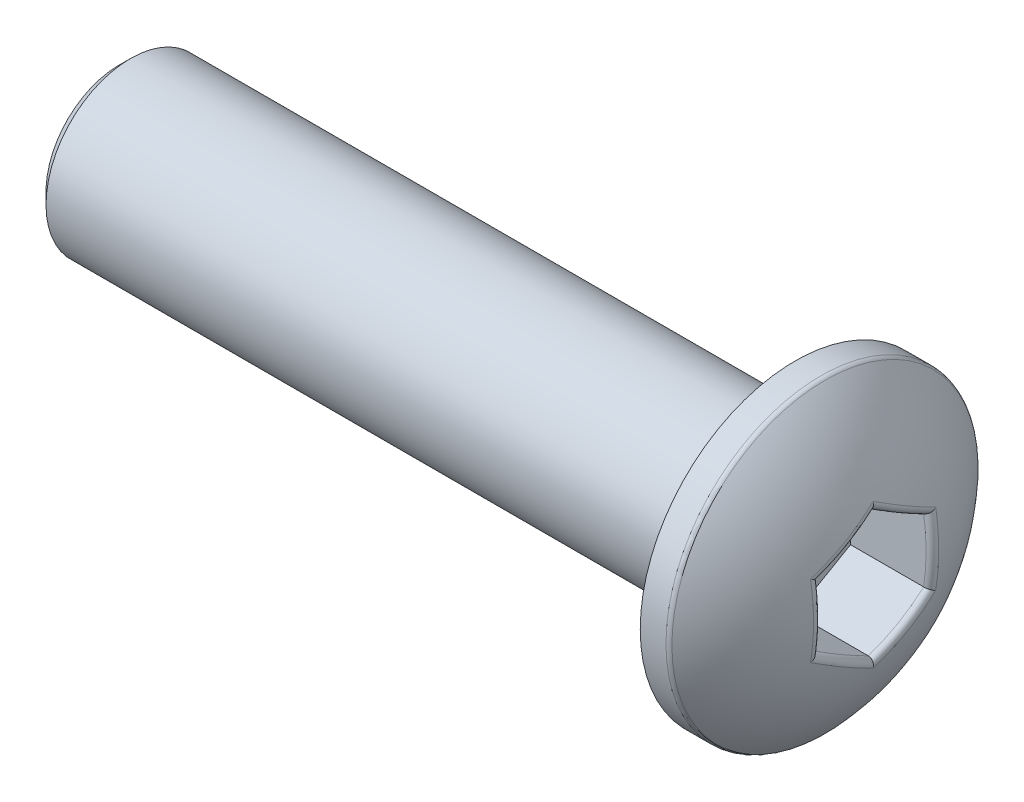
ISO-10303-21;
HEADER;
FILE_DESCRIPTION(('STEP AP214'),'2;1');
FILE_NAME('part.step','',(''),(''),'','','');
FILE_SCHEMA(('AUTOMOTIVE_DESIGN { 1 0 10303 214 1 1 1 1 }'));
ENDSEC;
DATA;
#1=APPLICATION_CONTEXT('core data for automotive mechanical design processes');
#2=APPLICATION_PROTOCOL_DEFINITION('international standard','automotive_design',2000,#1);
#3=PRODUCT_CONTEXT('',#1,'mechanical');
#4=PRODUCT('Part','Part','',(#3));
#5=PRODUCT_RELATED_PRODUCT_CATEGORY('part','',(#4));
#6=PRODUCT_DEFINITION_FORMATION('','',#4);
#7=PRODUCT_DEFINITION_CONTEXT('part definition',#1,'design');
#8=PRODUCT_DEFINITION('design','',#6,#7);
#9=PRODUCT_DEFINITION_SHAPE('','',#8);
#10=(LENGTH_UNIT() NAMED_UNIT(*) SI_UNIT(.MILLI.,.METRE.));
#11=(NAMED_UNIT(*) PLANE_ANGLE_UNIT() SI_UNIT($,.RADIAN.));
#12=(NAMED_UNIT(*) SI_UNIT($,.STERADIAN.) SOLID_ANGLE_UNIT());
#13=UNCERTAINTY_MEASURE_WITH_UNIT(LENGTH_MEASURE(1.E-05),#10,'distance_accuracy_value','');
#14=(GEOMETRIC_REPRESENTATION_CONTEXT(3) GLOBAL_UNCERTAINTY_ASSIGNED_CONTEXT((#13)) GLOBAL_UNIT_ASSIGNED_CONTEXT((#10,
#11,#12)) REPRESENTATION_CONTEXT('',''));
#15=CARTESIAN_POINT('',(0.,0.,0.));
#16=DIRECTION('',(0.,0.,1.));
#17=DIRECTION('',(1.,0.,0.));
#18=AXIS2_PLACEMENT_3D('',#15,#16,#17);
#19=CARTESIAN_POINT('',(9.59526249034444,0.,0.));
#20=DIRECTION('',(-1.,0.,0.));
#21=DIRECTION('',(0.,1.,0.));
#22=AXIS2_PLACEMENT_3D('',#19,#20,#21);
#23=SPHERICAL_SURFACE('',#22,4.);
#24=CARTESIAN_POINT('',(9.59526249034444,-0.962061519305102,0.555446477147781));
#25=DIRECTION('',(0.,0.866025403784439,-0.5));
#26=DIRECTION('',(0.,0.5,0.866025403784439));
#27=AXIS2_PLACEMENT_3D('',#24,#25,#26);
#28=CIRCLE('',#27,3.84264451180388);
#29=CARTESIAN_POINT('',(13.384003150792,-1.2827486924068,0.));
#30=VERTEX_POINT('',#29);
#31=CARTESIAN_POINT('',(13.384003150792,-0.641374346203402,1.11089295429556));
#32=VERTEX_POINT('',#31);
#33=EDGE_CURVE('E155',#30,#32,#28,.F.);
#34=ORIENTED_EDGE('',*,*,#33,.T.);
#35=CARTESIAN_POINT('',(9.59526249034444,0.,1.11089295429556));
#36=DIRECTION('',(0.,0.,-1.));
#37=DIRECTION('',(0.,1.,0.));
#38=AXIS2_PLACEMENT_3D('',#35,#36,#37);
#39=CIRCLE('',#38,3.84264451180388);
#40=CARTESIAN_POINT('',(13.384003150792,0.6413743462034,1.11089295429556));
#41=VERTEX_POINT('',#40);
#42=EDGE_CURVE('E157',#32,#41,#39,.F.);
#43=ORIENTED_EDGE('',*,*,#42,.T.);
#44=CARTESIAN_POINT('',(9.59526249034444,0.962061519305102,0.555446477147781));
#45=DIRECTION('',(0.,-0.866025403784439,-0.5));
#46=DIRECTION('',(0.,0.5,-0.866025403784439));
#47=AXIS2_PLACEMENT_3D('',#44,#45,#46);
#48=CIRCLE('',#47,3.84264451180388);
#49=CARTESIAN_POINT('',(13.384003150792,1.2827486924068,0.));
#50=VERTEX_POINT('',#49);
#51=EDGE_CURVE('E147',#41,#50,#48,.F.);
#52=ORIENTED_EDGE('',*,*,#51,.T.);
#53=CARTESIAN_POINT('',(9.59526249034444,0.9620615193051,-0.55544647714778));
#54=DIRECTION('',(0.,-0.866025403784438,0.5));
#55=DIRECTION('',(0.,-0.5,-0.866025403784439));
#56=AXIS2_PLACEMENT_3D('',#53,#54,#55);
#57=CIRCLE('',#56,3.84264451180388);
#58=CARTESIAN_POINT('',(13.384003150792,0.6413743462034,-1.11089295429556));
#59=VERTEX_POINT('',#58);
#60=EDGE_CURVE('E149',#50,#59,#57,.F.);
#61=ORIENTED_EDGE('',*,*,#60,.T.);
#62=CARTESIAN_POINT('',(9.59526249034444,0.,-1.11089295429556));
#63=DIRECTION('',(0.,0.,1.));
#64=DIRECTION('',(1.,0.,0.));
#65=AXIS2_PLACEMENT_3D('',#62,#63,#64);
#66=CIRCLE('',#65,3.84264451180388);
#67=CARTESIAN_POINT('',(13.384003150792,-0.641374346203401,-1.11089295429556));
#68=VERTEX_POINT('',#67);
#69=EDGE_CURVE('E151',#59,#68,#66,.F.);
#70=ORIENTED_EDGE('',*,*,#69,.T.);
#71=CARTESIAN_POINT('',(9.59526249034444,-0.962061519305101,-0.55544647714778));
#72=DIRECTION('',(0.,0.866025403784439,0.499999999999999));
#73=DIRECTION('',(0.,-0.5,0.866025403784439));
#74=AXIS2_PLACEMENT_3D('',#71,#72,#73);
#75=CIRCLE('',#74,3.84264451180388);
#76=EDGE_CURVE('E153',#68,#30,#75,.F.);
#77=ORIENTED_EDGE('',*,*,#76,.T.);
#78=EDGE_LOOP('',(#34,#43,#52,#61,#70,#77));
#79=FACE_BOUND('',#78,.T.);
#80=CARTESIAN_POINT('',(12.5300120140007,0.,0.));
#81=DIRECTION('',(-1.,0.,0.));
#82=DIRECTION('',(0.,0.,1.));
#83=AXIS2_PLACEMENT_3D('',#80,#81,#82);
#84=CIRCLE('',#83,2.71794871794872);
#85=CARTESIAN_POINT('',(12.5300120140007,0.,2.71794871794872));
#86=VERTEX_POINT('',#85);
#87=EDGE_CURVE('E144',#86,#86,#84,.F.);
#88=ORIENTED_EDGE('',*,*,#87,.T.);
#89=EDGE_LOOP('',(#88));
#90=FACE_BOUND('',#89,.T.);
#91=ADVANCED_FACE('F32',(#79,#90),#23,.T.);
#92=CARTESIAN_POINT('',(0.,0.,0.));
#93=DIRECTION('',(-1.,0.,0.));
#94=DIRECTION('',(0.,0.,1.));
#95=AXIS2_PLACEMENT_3D('',#92,#93,#94);
#96=CYLINDRICAL_SURFACE('',#95,2.75);
#97=CARTESIAN_POINT('',(12.4566432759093,0.,0.));
#98=DIRECTION('',(-1.,0.,0.));
#99=DIRECTION('',(0.,0.,1.));
#100=AXIS2_PLACEMENT_3D('',#97,#98,#99);
#101=CIRCLE('',#100,2.75);
#102=CARTESIAN_POINT('',(12.4566432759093,0.,2.75));
#103=VERTEX_POINT('',#102);
#104=EDGE_CURVE('E11',#103,#103,#101,.T.);
#105=ORIENTED_EDGE('',*,*,#104,.T.);
#106=EDGE_LOOP('',(#105));
#107=FACE_BOUND('',#106,.T.);
#108=CARTESIAN_POINT('',(12.,0.,0.));
#109=DIRECTION('',(-1.,0.,0.));
#110=DIRECTION('',(0.,0.,1.));
#111=AXIS2_PLACEMENT_3D('',#108,#109,#110);
#112=CIRCLE('',#111,2.75);
#113=CARTESIAN_POINT('',(12.,0.,2.75));
#114=VERTEX_POINT('',#113);
#115=EDGE_CURVE('E127',#114,#114,#112,.T.);
#116=ORIENTED_EDGE('',*,*,#115,.F.);
#117=EDGE_LOOP('',(#116));
#118=FACE_BOUND('',#117,.T.);
#119=ADVANCED_FACE('F270',(#107,#118),#96,.T.);
#120=CARTESIAN_POINT('',(12.,1.5,0.));
#121=DIRECTION('',(1.,0.,0.));
#122=DIRECTION('',(0.,0.,-1.));
#123=AXIS2_PLACEMENT_3D('',#120,#121,#122);
#124=PLANE('',#123);
#125=CARTESIAN_POINT('',(12.,0.,0.));
#126=DIRECTION('',(-1.,0.,0.));
#127=DIRECTION('',(0.,0.,1.));
#128=AXIS2_PLACEMENT_3D('',#125,#126,#127);
#129=CIRCLE('',#128,1.5);
#130=CARTESIAN_POINT('',(12.,0.,1.5));
#131=VERTEX_POINT('',#130);
#132=EDGE_CURVE('E123',#131,#131,#129,.T.);
#133=ORIENTED_EDGE('',*,*,#132,.F.);
#134=EDGE_LOOP('',(#133));
#135=FACE_BOUND('',#134,.T.);
#136=ORIENTED_EDGE('',*,*,#115,.T.);
#137=EDGE_LOOP('',(#136));
#138=FACE_BOUND('',#137,.T.);
#139=ADVANCED_FACE('F267',(#135,#138),#124,.F.);
#140=CARTESIAN_POINT('',(0.,0.,0.));
#141=DIRECTION('',(-1.,0.,0.));
#142=DIRECTION('',(0.,0.,1.));
#143=AXIS2_PLACEMENT_3D('',#140,#141,#142);
#144=CYLINDRICAL_SURFACE('',#143,1.5);
#145=CARTESIAN_POINT('',(0.200000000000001,0.,0.));
#146=DIRECTION('',(1.,0.,0.));
#147=DIRECTION('',(0.,0.,-1.));
#148=AXIS2_PLACEMENT_3D('',#145,#146,#147);
#149=CIRCLE('',#148,1.5);
#150=CARTESIAN_POINT('',(0.200000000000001,0.,-1.5));
#151=VERTEX_POINT('',#150);
#152=EDGE_CURVE('E138',#151,#151,#149,.T.);
#153=ORIENTED_EDGE('',*,*,#152,.T.);
#154=EDGE_LOOP('',(#153));
#155=FACE_BOUND('',#154,.T.);
#156=ORIENTED_EDGE('',*,*,#132,.T.);
#157=EDGE_LOOP('',(#156));
#158=FACE_BOUND('',#157,.T.);
#159=ADVANCED_FACE('F263',(#155,#158),#144,.T.);
#160=CARTESIAN_POINT('',(0.,0.,0.));
#161=DIRECTION('',(1.,0.,0.));
#162=DIRECTION('',(0.,0.,-1.));
#163=AXIS2_PLACEMENT_3D('',#160,#161,#162);
#164=PLANE('',#163);
#165=CARTESIAN_POINT('',(0.,0.,0.));
#166=DIRECTION('',(1.,0.,0.));
#167=DIRECTION('',(0.,0.,-1.));
#168=AXIS2_PLACEMENT_3D('',#165,#166,#167);
#169=CIRCLE('',#168,1.3);
#170=CARTESIAN_POINT('',(0.,0.,-1.3));
#171=VERTEX_POINT('',#170);
#172=EDGE_CURVE('E135',#171,#171,#169,.F.);
#173=ORIENTED_EDGE('',*,*,#172,.T.);
#174=EDGE_LOOP('',(#173));
#175=FACE_BOUND('',#174,.T.);
#176=ADVANCED_FACE('F260',(#175),#164,.F.);
#177=CARTESIAN_POINT('',(12.,0.567604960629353,0.983120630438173));
#178=DIRECTION('',(0.,-0.866025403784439,-0.5));
#179=DIRECTION('',(0.,0.5,-0.866025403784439));
#180=AXIS2_PLACEMENT_3D('',#177,#178,#179);
#181=PLANE('',#180);
#182=DIRECTION('',(1.,0.,0.));
#183=VECTOR('',#182,1.);
#184=CARTESIAN_POINT('',(12.,1.13520992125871,0.));
#185=LINE('',#184,#183);
#186=CARTESIAN_POINT('',(12.,1.13520992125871,0.));
#187=VERTEX_POINT('',#186);
#188=CARTESIAN_POINT('',(13.2985953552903,1.13520992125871,0.));
#189=VERTEX_POINT('',#188);
#190=EDGE_CURVE('E116',#187,#189,#185,.T.);
#191=ORIENTED_EDGE('',*,*,#190,.T.);
#192=CARTESIAN_POINT('',(9.59526249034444,0.85140744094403,0.491560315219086));
#193=DIRECTION('',(0.,-0.866025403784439,-0.5));
#194=DIRECTION('',(0.,0.5,-0.866025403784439));
#195=AXIS2_PLACEMENT_3D('',#192,#193,#194);
#196=CIRCLE('',#195,3.74657839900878);
#197=CARTESIAN_POINT('',(13.2985953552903,0.567604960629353,0.983120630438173));
#198=VERTEX_POINT('',#197);
#199=EDGE_CURVE('E39',#189,#198,#196,.T.);
#200=ORIENTED_EDGE('',*,*,#199,.T.);
#201=DIRECTION('',(1.,0.,0.));
#202=VECTOR('',#201,1.);
#203=CARTESIAN_POINT('',(12.,0.567604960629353,0.983120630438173));
#204=LINE('',#203,#202);
#205=CARTESIAN_POINT('',(12.,0.567604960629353,0.983120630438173));
#206=VERTEX_POINT('',#205);
#207=EDGE_CURVE('E119',#206,#198,#204,.T.);
#208=ORIENTED_EDGE('',*,*,#207,.F.);
#209=DIRECTION('',(0.,0.5,-0.866025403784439));
#210=VECTOR('',#209,1.);
#211=CARTESIAN_POINT('',(12.,0.567604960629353,0.983120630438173));
#212=LINE('',#211,#210);
#213=EDGE_CURVE('E109',#206,#187,#212,.T.);
#214=ORIENTED_EDGE('',*,*,#213,.T.);
#215=EDGE_LOOP('',(#191,#200,#208,#214));
#216=FACE_BOUND('',#215,.T.);
#217=ADVANCED_FACE('F115',(#216),#181,.T.);
#218=CARTESIAN_POINT('',(12.,1.13520992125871,0.));
#219=DIRECTION('',(0.,-0.866025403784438,0.5));
#220=DIRECTION('',(0.,-0.5,-0.866025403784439));
#221=AXIS2_PLACEMENT_3D('',#218,#219,#220);
#222=PLANE('',#221);
#223=DIRECTION('',(1.,0.,0.));
#224=VECTOR('',#223,1.);
#225=CARTESIAN_POINT('',(12.,0.567604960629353,-0.983120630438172));
#226=LINE('',#225,#224);
#227=CARTESIAN_POINT('',(12.,0.567604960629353,-0.983120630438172));
#228=VERTEX_POINT('',#227);
#229=CARTESIAN_POINT('',(13.2985953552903,0.567604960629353,-0.983120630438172));
#230=VERTEX_POINT('',#229);
#231=EDGE_CURVE('E124',#228,#230,#226,.T.);
#232=ORIENTED_EDGE('',*,*,#231,.T.);
#233=CARTESIAN_POINT('',(9.59526249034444,0.85140744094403,-0.491560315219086));
#234=DIRECTION('',(0.,-0.866025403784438,0.5));
#235=DIRECTION('',(0.,-0.5,-0.866025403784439));
#236=AXIS2_PLACEMENT_3D('',#233,#234,#235);
#237=CIRCLE('',#236,3.74657839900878);
#238=EDGE_CURVE('E46',#230,#189,#237,.T.);
#239=ORIENTED_EDGE('',*,*,#238,.T.);
#240=ORIENTED_EDGE('',*,*,#190,.F.);
#241=DIRECTION('',(0.,-0.5,-0.866025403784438));
#242=VECTOR('',#241,1.);
#243=CARTESIAN_POINT('',(12.,1.13520992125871,0.));
#244=LINE('',#243,#242);
#245=EDGE_CURVE('E105',#187,#228,#244,.T.);
#246=ORIENTED_EDGE('',*,*,#245,.T.);
#247=EDGE_LOOP('',(#232,#239,#240,#246));
#248=FACE_BOUND('',#247,.T.);
#249=ADVANCED_FACE('F122',(#248),#222,.T.);
#250=CARTESIAN_POINT('',(12.,0.567604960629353,-0.983120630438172));
#251=DIRECTION('',(0.,0.,1.));
#252=DIRECTION('',(1.,0.,0.));
#253=AXIS2_PLACEMENT_3D('',#250,#251,#252);
#254=PLANE('',#253);
#255=DIRECTION('',(1.,0.,0.));
#256=VECTOR('',#255,1.);
#257=CARTESIAN_POINT('',(12.,-0.567604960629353,-0.983120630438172));
#258=LINE('',#257,#256);
#259=CARTESIAN_POINT('',(12.,-0.567604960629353,-0.983120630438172));
#260=VERTEX_POINT('',#259);
#261=CARTESIAN_POINT('',(13.2985953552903,-0.567604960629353,-0.983120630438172));
#262=VERTEX_POINT('',#261);
#263=EDGE_CURVE('E129',#260,#262,#258,.T.);
#264=ORIENTED_EDGE('',*,*,#263,.T.);
#265=CARTESIAN_POINT('',(9.59526249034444,0.,-0.983120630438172));
#266=DIRECTION('',(0.,0.,1.));
#267=DIRECTION('',(1.,0.,0.));
#268=AXIS2_PLACEMENT_3D('',#265,#266,#267);
#269=CIRCLE('',#268,3.74657839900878);
#270=EDGE_CURVE('E54',#262,#230,#269,.T.);
#271=ORIENTED_EDGE('',*,*,#270,.T.);
#272=ORIENTED_EDGE('',*,*,#231,.F.);
#273=DIRECTION('',(0.,-1.,0.));
#274=VECTOR('',#273,1.);
#275=CARTESIAN_POINT('',(12.,0.567604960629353,-0.983120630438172));
#276=LINE('',#275,#274);
#277=EDGE_CURVE('E111',#228,#260,#276,.T.);
#278=ORIENTED_EDGE('',*,*,#277,.T.);
#279=EDGE_LOOP('',(#264,#271,#272,#278));
#280=FACE_BOUND('',#279,.T.);
#281=ADVANCED_FACE('F253',(#280),#254,.T.);
#282=CARTESIAN_POINT('',(12.,-0.567604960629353,-0.983120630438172));
#283=DIRECTION('',(0.,0.866025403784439,0.499999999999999));
#284=DIRECTION('',(0.,-0.5,0.866025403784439));
#285=AXIS2_PLACEMENT_3D('',#282,#283,#284);
#286=PLANE('',#285);
#287=DIRECTION('',(1.,0.,0.));
#288=VECTOR('',#287,1.);
#289=CARTESIAN_POINT('',(12.,-1.13520992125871,0.));
#290=LINE('',#289,#288);
#291=CARTESIAN_POINT('',(12.,-1.13520992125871,0.));
#292=VERTEX_POINT('',#291);
#293=CARTESIAN_POINT('',(13.2985953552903,-1.13520992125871,0.));
#294=VERTEX_POINT('',#293);
#295=EDGE_CURVE('E198',#292,#294,#290,.T.);
#296=ORIENTED_EDGE('',*,*,#295,.T.);
#297=CARTESIAN_POINT('',(9.59526249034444,-0.85140744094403,-0.491560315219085));
#298=DIRECTION('',(0.,0.866025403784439,0.499999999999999));
#299=DIRECTION('',(0.,-0.5,0.866025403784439));
#300=AXIS2_PLACEMENT_3D('',#297,#298,#299);
#301=CIRCLE('',#300,3.74657839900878);
#302=EDGE_CURVE('E162',#294,#262,#301,.T.);
#303=ORIENTED_EDGE('',*,*,#302,.T.);
#304=ORIENTED_EDGE('',*,*,#263,.F.);
#305=DIRECTION('',(0.,-0.499999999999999,0.866025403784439));
#306=VECTOR('',#305,1.);
#307=CARTESIAN_POINT('',(12.,-0.567604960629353,-0.983120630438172));
#308=LINE('',#307,#306);
#309=EDGE_CURVE('E204',#260,#292,#308,.T.);
#310=ORIENTED_EDGE('',*,*,#309,.T.);
#311=EDGE_LOOP('',(#296,#303,#304,#310));
#312=FACE_BOUND('',#311,.T.);
#313=ADVANCED_FACE('F202',(#312),#286,.T.);
#314=CARTESIAN_POINT('',(12.,-1.13520992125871,0.));
#315=DIRECTION('',(0.,0.866025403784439,-0.5));
#316=DIRECTION('',(0.,0.5,0.866025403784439));
#317=AXIS2_PLACEMENT_3D('',#314,#315,#316);
#318=PLANE('',#317);
#319=DIRECTION('',(1.,0.,0.));
#320=VECTOR('',#319,1.);
#321=CARTESIAN_POINT('',(12.,-0.567604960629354,0.983120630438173));
#322=LINE('',#321,#320);
#323=CARTESIAN_POINT('',(12.,-0.567604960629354,0.983120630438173));
#324=VERTEX_POINT('',#323);
#325=CARTESIAN_POINT('',(13.2985953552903,-0.567604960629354,0.983120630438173));
#326=VERTEX_POINT('',#325);
#327=EDGE_CURVE('E175',#324,#326,#322,.T.);
#328=ORIENTED_EDGE('',*,*,#327,.T.);
#329=CARTESIAN_POINT('',(9.59526249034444,-0.851407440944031,0.491560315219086));
#330=DIRECTION('',(0.,0.866025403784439,-0.5));
#331=DIRECTION('',(0.,0.5,0.866025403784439));
#332=AXIS2_PLACEMENT_3D('',#329,#330,#331);
#333=CIRCLE('',#332,3.74657839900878);
#334=EDGE_CURVE('E160',#326,#294,#333,.T.);
#335=ORIENTED_EDGE('',*,*,#334,.T.);
#336=ORIENTED_EDGE('',*,*,#295,.F.);
#337=DIRECTION('',(0.,0.5,0.866025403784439));
#338=VECTOR('',#337,1.);
#339=CARTESIAN_POINT('',(12.,-1.13520992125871,0.));
#340=LINE('',#339,#338);
#341=EDGE_CURVE('E440',#292,#324,#340,.T.);
#342=ORIENTED_EDGE('',*,*,#341,.T.);
#343=EDGE_LOOP('',(#328,#335,#336,#342));
#344=FACE_BOUND('',#343,.T.);
#345=ADVANCED_FACE('F197',(#344),#318,.T.);
#346=CARTESIAN_POINT('',(12.,-0.567604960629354,0.983120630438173));
#347=DIRECTION('',(0.,0.,-1.));
#348=DIRECTION('',(0.,1.,0.));
#349=AXIS2_PLACEMENT_3D('',#346,#347,#348);
#350=PLANE('',#349);
#351=ORIENTED_EDGE('',*,*,#207,.T.);
#352=CARTESIAN_POINT('',(9.59526249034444,0.,0.983120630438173));
#353=DIRECTION('',(0.,0.,-1.));
#354=DIRECTION('',(0.,1.,0.));
#355=AXIS2_PLACEMENT_3D('',#352,#353,#354);
#356=CIRCLE('',#355,3.74657839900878);
#357=EDGE_CURVE('E141',#198,#326,#356,.T.);
#358=ORIENTED_EDGE('',*,*,#357,.T.);
#359=ORIENTED_EDGE('',*,*,#327,.F.);
#360=DIRECTION('',(0.,1.,0.));
#361=VECTOR('',#360,1.);
#362=CARTESIAN_POINT('',(12.,-0.567604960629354,0.983120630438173));
#363=LINE('',#362,#361);
#364=EDGE_CURVE('E174',#324,#206,#363,.T.);
#365=ORIENTED_EDGE('',*,*,#364,.T.);
#366=EDGE_LOOP('',(#351,#358,#359,#365));
#367=FACE_BOUND('',#366,.T.);
#368=ADVANCED_FACE('F170',(#367),#350,.T.);
#369=CARTESIAN_POINT('',(12.,1.13520992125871,0.));
#370=DIRECTION('',(-1.,0.,0.));
#371=DIRECTION('',(0.,0.,1.));
#372=AXIS2_PLACEMENT_3D('',#369,#370,#371);
#373=PLANE('',#372);
#374=ORIENTED_EDGE('',*,*,#213,.F.);
#375=ORIENTED_EDGE('',*,*,#364,.F.);
#376=ORIENTED_EDGE('',*,*,#341,.F.);
#377=ORIENTED_EDGE('',*,*,#309,.F.);
#378=ORIENTED_EDGE('',*,*,#277,.F.);
#379=ORIENTED_EDGE('',*,*,#245,.F.);
#380=EDGE_LOOP('',(#374,#375,#376,#377,#378,#379));
#381=FACE_BOUND('',#380,.T.);
#382=ADVANCED_FACE('F107',(#381),#373,.F.);
#383=CARTESIAN_POINT('',(0.,0.,0.));
#384=DIRECTION('',(1.,0.,0.));
#385=DIRECTION('',(0.,0.,-1.));
#386=AXIS2_PLACEMENT_3D('',#383,#384,#385);
#387=CONICAL_SURFACE('',#386,1.3,0.785398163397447);
#388=CARTESIAN_POINT('',(0.200000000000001,0.,-1.5));
#389=CARTESIAN_POINT('',(0.197916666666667,0.,-1.49791666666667));
#390=CARTESIAN_POINT('',(0.195833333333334,0.,-1.49583333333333));
#391=CARTESIAN_POINT('',(0.191666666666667,0.,-1.49166666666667));
#392=CARTESIAN_POINT('',(0.189583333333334,0.,-1.48958333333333));
#393=CARTESIAN_POINT('',(0.185416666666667,0.,-1.48541666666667));
#394=CARTESIAN_POINT('',(0.183333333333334,0.,-1.48333333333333));
#395=CARTESIAN_POINT('',(0.179166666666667,0.,-1.47916666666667));
#396=CARTESIAN_POINT('',(0.177083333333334,0.,-1.47708333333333));
#397=CARTESIAN_POINT('',(0.172916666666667,0.,-1.47291666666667));
#398=CARTESIAN_POINT('',(0.170833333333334,0.,-1.47083333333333));
#399=CARTESIAN_POINT('',(0.166666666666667,0.,-1.46666666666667));
#400=CARTESIAN_POINT('',(0.164583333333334,0.,-1.46458333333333));
#401=CARTESIAN_POINT('',(0.160416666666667,0.,-1.46041666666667));
#402=CARTESIAN_POINT('',(0.158333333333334,0.,-1.45833333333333));
#403=CARTESIAN_POINT('',(0.154166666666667,0.,-1.45416666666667));
#404=CARTESIAN_POINT('',(0.152083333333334,0.,-1.45208333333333));
#405=CARTESIAN_POINT('',(0.147916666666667,0.,-1.44791666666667));
#406=CARTESIAN_POINT('',(0.145833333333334,0.,-1.44583333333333));
#407=CARTESIAN_POINT('',(0.141666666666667,0.,-1.44166666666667));
#408=CARTESIAN_POINT('',(0.139583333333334,0.,-1.43958333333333));
#409=CARTESIAN_POINT('',(0.135416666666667,0.,-1.43541666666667));
#410=CARTESIAN_POINT('',(0.133333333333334,0.,-1.43333333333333));
#411=CARTESIAN_POINT('',(0.129166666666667,0.,-1.42916666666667));
#412=CARTESIAN_POINT('',(0.127083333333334,0.,-1.42708333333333));
#413=CARTESIAN_POINT('',(0.122916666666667,0.,-1.42291666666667));
#414=CARTESIAN_POINT('',(0.120833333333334,0.,-1.42083333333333));
#415=CARTESIAN_POINT('',(0.116666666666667,0.,-1.41666666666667));
#416=CARTESIAN_POINT('',(0.114583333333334,0.,-1.41458333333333));
#417=CARTESIAN_POINT('',(0.110416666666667,0.,-1.41041666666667));
#418=CARTESIAN_POINT('',(0.108333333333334,0.,-1.40833333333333));
#419=CARTESIAN_POINT('',(0.104166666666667,0.,-1.40416666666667));
#420=CARTESIAN_POINT('',(0.102083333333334,0.,-1.40208333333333));
#421=CARTESIAN_POINT('',(0.097916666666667,0.,-1.39791666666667));
#422=CARTESIAN_POINT('',(0.0958333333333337,0.,-1.39583333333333));
#423=CARTESIAN_POINT('',(0.091666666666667,0.,-1.39166666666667));
#424=CARTESIAN_POINT('',(0.0895833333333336,0.,-1.38958333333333));
#425=CARTESIAN_POINT('',(0.0854166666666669,0.,-1.38541666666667));
#426=CARTESIAN_POINT('',(0.0833333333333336,0.,-1.38333333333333));
#427=CARTESIAN_POINT('',(0.079166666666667,0.,-1.37916666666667));
#428=CARTESIAN_POINT('',(0.0770833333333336,0.,-1.37708333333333));
#429=CARTESIAN_POINT('',(0.0729166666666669,0.,-1.37291666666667));
#430=CARTESIAN_POINT('',(0.0708333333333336,0.,-1.37083333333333));
#431=CARTESIAN_POINT('',(0.0666666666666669,0.,-1.36666666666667));
#432=CARTESIAN_POINT('',(0.0645833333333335,0.,-1.36458333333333));
#433=CARTESIAN_POINT('',(0.0604166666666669,0.,-1.36041666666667));
#434=CARTESIAN_POINT('',(0.0583333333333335,0.,-1.35833333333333));
#435=CARTESIAN_POINT('',(0.0541666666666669,0.,-1.35416666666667));
#436=CARTESIAN_POINT('',(0.0520833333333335,0.,-1.35208333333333));
#437=CARTESIAN_POINT('',(0.0479166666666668,0.,-1.34791666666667));
#438=CARTESIAN_POINT('',(0.0458333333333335,0.,-1.34583333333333));
#439=CARTESIAN_POINT('',(0.0416666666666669,0.,-1.34166666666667));
#440=CARTESIAN_POINT('',(0.0395833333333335,0.,-1.33958333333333));
#441=CARTESIAN_POINT('',(0.0354166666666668,0.,-1.33541666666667));
#442=CARTESIAN_POINT('',(0.0333333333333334,0.,-1.33333333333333));
#443=CARTESIAN_POINT('',(0.0291666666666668,0.,-1.32916666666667));
#444=CARTESIAN_POINT('',(0.0270833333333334,0.,-1.32708333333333));
#445=CARTESIAN_POINT('',(0.0229166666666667,0.,-1.32291666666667));
#446=CARTESIAN_POINT('',(0.0208333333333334,0.,-1.32083333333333));
#447=CARTESIAN_POINT('',(0.0166666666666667,0.,-1.31666666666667));
#448=CARTESIAN_POINT('',(0.0145833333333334,0.,-1.31458333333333));
#449=CARTESIAN_POINT('',(0.0104166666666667,0.,-1.31041666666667));
#450=CARTESIAN_POINT('',(0.00833333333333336,0.,-1.30833333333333));
#451=CARTESIAN_POINT('',(0.00416666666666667,0.,-1.30416666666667));
#452=CARTESIAN_POINT('',(0.00208333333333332,0.,-1.30208333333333));
#453=CARTESIAN_POINT('',(0.,0.,-1.3));
#454=B_SPLINE_CURVE_WITH_KNOTS('',3,(#388,#389,#390,#391,#392,#393,#394,#395,#396,#397,#398,
#399,#400,#401,#402,#403,#404,#405,#406,#407,#408,#409,#410,#411,#412,#413,#414,#415,#416,#417,
#418,#419,#420,#421,#422,#423,#424,#425,#426,#427,#428,#429,#430,#431,#432,#433,#434,#435,#436,
#437,#438,#439,#440,#441,#442,#443,#444,#445,#446,#447,#448,#449,#450,#451,#452,#453),
.UNSPECIFIED.,.F.,.F.,(4,2,2,2,2,2,2,2,2,2,2,2,2,2,2,2,2,2,2,2,2,2,2,2,2,2,2,2,2,2,2,2,4),(0.,
0.00883883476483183,0.0176776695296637,0.0265165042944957,0.0353553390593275,0.0441941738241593,
0.0530330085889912,0.061871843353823,0.0707106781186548,0.0795495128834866,0.0883883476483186,
0.0972271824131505,0.106066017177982,0.114904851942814,0.123743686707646,0.132582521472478,
0.14142135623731,0.150260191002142,0.159099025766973,0.167937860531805,0.176776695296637,
0.185615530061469,0.194454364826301,0.203293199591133,0.212132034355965,0.220970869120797,
0.229809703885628,0.23864853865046,0.247487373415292,0.256326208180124,0.265165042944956,
0.274003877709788,0.28284271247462),.UNSPECIFIED.);
#455=EDGE_CURVE('BSEAM239',#151,#171,#454,.T.);
#456=ORIENTED_EDGE('',*,*,#152,.F.);
#457=ORIENTED_EDGE('',*,*,#172,.F.);
#458=ORIENTED_EDGE('',*,*,#455,.T.);
#459=ORIENTED_EDGE('',*,*,#455,.F.);
#460=EDGE_LOOP('',(#456,#458,#457,#459));
#461=FACE_BOUND('',#460,.T.);
#462=ADVANCED_FACE('F239',(#461),#387,.T.);
#463=CARTESIAN_POINT('',(9.59526249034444,0.,-1.08312063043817));
#464=DIRECTION('',(0.,0.,1.));
#465=DIRECTION('',(1.,0.,0.));
#466=AXIS2_PLACEMENT_3D('',#463,#464,#465);
#467=TOROIDAL_SURFACE('',#466,3.74657839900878,0.1);
#468=CARTESIAN_POINT('',(13.2985953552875,-0.567604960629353,-0.983120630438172));
#469=CARTESIAN_POINT('',(13.303472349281,-0.567601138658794,-0.983114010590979));
#470=CARTESIAN_POINT('',(13.3083502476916,-0.567806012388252,-0.983468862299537));
#471=CARTESIAN_POINT('',(13.3179587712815,-0.568621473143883,-0.984881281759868));
#472=CARTESIAN_POINT('',(13.3226896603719,-0.569231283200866,-0.985937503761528));
#473=CARTESIAN_POINT('',(13.3318797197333,-0.570845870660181,-0.988734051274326));
#474=CARTESIAN_POINT('',(13.3363385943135,-0.571851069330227,-0.990475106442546));
#475=CARTESIAN_POINT('',(13.3448556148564,-0.57421950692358,-0.99457736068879));
#476=CARTESIAN_POINT('',(13.3489138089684,-0.575582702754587,-0.99693848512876));
#477=CARTESIAN_POINT('',(13.3565571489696,-0.578626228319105,-1.00221002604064));
#478=CARTESIAN_POINT('',(13.3601395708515,-0.580308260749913,-1.00512339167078));
#479=CARTESIAN_POINT('',(13.3667439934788,-0.583927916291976,-1.01139281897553));
#480=CARTESIAN_POINT('',(13.3697657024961,-0.585865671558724,-1.01474910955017));
#481=CARTESIAN_POINT('',(13.3754523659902,-0.590117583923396,-1.02211363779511));
#482=CARTESIAN_POINT('',(13.3780630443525,-0.592449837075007,-1.02615321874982));
#483=CARTESIAN_POINT('',(13.3825675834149,-0.597280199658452,-1.03451965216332));
#484=CARTESIAN_POINT('',(13.3844612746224,-0.599778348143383,-1.03884657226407));
#485=CARTESIAN_POINT('',(13.3877426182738,-0.605218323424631,-1.04826888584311));
#486=CARTESIAN_POINT('',(13.3890304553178,-0.608175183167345,-1.05339031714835));
#487=CARTESIAN_POINT('',(13.3907245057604,-0.614152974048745,-1.06374415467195));
#488=CARTESIAN_POINT('',(13.3911297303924,-0.617173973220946,-1.06897667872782));
#489=CARTESIAN_POINT('',(13.3910889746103,-0.623613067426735,-1.080129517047));
#490=CARTESIAN_POINT('',(13.3905235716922,-0.627030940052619,-1.08604944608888));
#491=CARTESIAN_POINT('',(13.3883582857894,-0.633778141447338,-1.0977359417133));
#492=CARTESIAN_POINT('',(13.3867604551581,-0.637107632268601,-1.10350278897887));
#493=CARTESIAN_POINT('',(13.3844570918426,-0.640695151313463,-1.1097165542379));
#494=CARTESIAN_POINT('',(13.3842327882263,-0.641035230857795,-1.11030558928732));
#495=CARTESIAN_POINT('',(13.384003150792,-0.641374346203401,-1.11089295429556));
#496=B_SPLINE_CURVE_WITH_KNOTS('',3,(#468,#469,#470,#471,#472,#473,#474,#475,#476,#477,#478,
#479,#480,#481,#482,#483,#484,#485,#486,#487,#488,#489,#490,#491,#492,#493,#494,#495),
.UNSPECIFIED.,.F.,.F.,(4,2,2,2,2,2,2,2,2,2,2,2,2,4),(0.,0.014614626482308,0.0292012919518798,
0.0438035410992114,0.0584040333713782,0.0730848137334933,0.0877732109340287,0.103745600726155,
0.119721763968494,0.137807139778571,0.15591276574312,0.17640838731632,0.196863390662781,
0.199011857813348),.UNSPECIFIED.);
#497=EDGE_CURVE('E211',#68,#262,#496,.F.);
#498=ORIENTED_EDGE('',*,*,#497,.F.);
#499=ORIENTED_EDGE('',*,*,#69,.F.);
#500=CARTESIAN_POINT('',(13.2985953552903,0.567604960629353,-0.983120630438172));
#501=CARTESIAN_POINT('',(13.3034723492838,0.567601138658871,-0.983114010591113));
#502=CARTESIAN_POINT('',(13.3083502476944,0.567806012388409,-0.98346886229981));
#503=CARTESIAN_POINT('',(13.3179587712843,0.568621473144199,-0.984881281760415));
#504=CARTESIAN_POINT('',(13.3226896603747,0.56923128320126,-0.985937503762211));
#505=CARTESIAN_POINT('',(13.3318797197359,0.570845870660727,-0.988734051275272));
#506=CARTESIAN_POINT('',(13.3363385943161,0.571851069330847,-0.99047510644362));
#507=CARTESIAN_POINT('',(13.3448556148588,0.574219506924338,-0.994577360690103));
#508=CARTESIAN_POINT('',(13.3489138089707,0.575582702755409,-0.996938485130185));
#509=CARTESIAN_POINT('',(13.3565571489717,0.578626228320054,-1.00221002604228));
#510=CARTESIAN_POINT('',(13.3601395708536,0.580308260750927,-1.00512339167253));
#511=CARTESIAN_POINT('',(13.3667439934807,0.583927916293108,-1.01139281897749));
#512=CARTESIAN_POINT('',(13.3697657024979,0.585865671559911,-1.01474910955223));
#513=CARTESIAN_POINT('',(13.3754523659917,0.590117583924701,-1.02211363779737));
#514=CARTESIAN_POINT('',(13.3780630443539,0.592449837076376,-1.02615321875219));
#515=CARTESIAN_POINT('',(13.3825675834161,0.597280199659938,-1.0345196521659));
#516=CARTESIAN_POINT('',(13.3844612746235,0.599778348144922,-1.03884657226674));
#517=CARTESIAN_POINT('',(13.3877426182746,0.605218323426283,-1.04826888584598));
#518=CARTESIAN_POINT('',(13.3890304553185,0.608175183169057,-1.05339031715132));
#519=CARTESIAN_POINT('',(13.3907245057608,0.614152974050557,-1.06374415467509));
#520=CARTESIAN_POINT('',(13.3911297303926,0.617173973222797,-1.06897667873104));
#521=CARTESIAN_POINT('',(13.3910889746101,0.62361306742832,-1.08012951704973));
#522=CARTESIAN_POINT('',(13.3905235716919,0.627030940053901,-1.08604944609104));
#523=CARTESIAN_POINT('',(13.3883582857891,0.633778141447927,-1.09773594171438));
#524=CARTESIAN_POINT('',(13.3867604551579,0.637107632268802,-1.10350278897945));
#525=CARTESIAN_POINT('',(13.3844570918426,0.640695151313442,-1.10971655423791));
#526=CARTESIAN_POINT('',(13.3842327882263,0.641035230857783,-1.11030558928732));
#527=CARTESIAN_POINT('',(13.384003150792,0.6413743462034,-1.11089295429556));
#528=B_SPLINE_CURVE_WITH_KNOTS('',3,(#500,#501,#502,#503,#504,#505,#506,#507,#508,#509,#510,
#511,#512,#513,#514,#515,#516,#517,#518,#519,#520,#521,#522,#523,#524,#525,#526,#527),
.UNSPECIFIED.,.F.,.F.,(4,2,2,2,2,2,2,2,2,2,2,2,2,4),(0.,0.0146146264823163,0.0292012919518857,
0.0438035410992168,0.0584040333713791,0.0730848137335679,0.0877732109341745,0.103745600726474,
0.119721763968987,0.1378071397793,0.155912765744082,0.176408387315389,0.196863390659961,
0.199011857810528),.UNSPECIFIED.);
#529=EDGE_CURVE('E120',#230,#59,#528,.T.);
#530=ORIENTED_EDGE('',*,*,#529,.F.);
#531=ORIENTED_EDGE('',*,*,#270,.F.);
#532=EDGE_LOOP('',(#498,#499,#530,#531));
#533=FACE_BOUND('',#532,.T.);
#534=ADVANCED_FACE('F234',(#533),#467,.T.);
#535=CARTESIAN_POINT('',(9.59526249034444,0.938009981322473,-0.541560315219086));
#536=DIRECTION('',(0.,-0.866025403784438,0.5));
#537=DIRECTION('',(0.,-0.5,-0.866025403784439));
#538=AXIS2_PLACEMENT_3D('',#535,#536,#537);
#539=TOROIDAL_SURFACE('',#538,3.74657839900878,0.1);
#540=ORIENTED_EDGE('',*,*,#529,.T.);
#541=ORIENTED_EDGE('',*,*,#60,.F.);
#542=CARTESIAN_POINT('',(13.2985953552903,1.13520992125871,0.));
#543=CARTESIAN_POINT('',(13.3034723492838,1.13520227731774,0.));
#544=CARTESIAN_POINT('',(13.3083502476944,1.13561202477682,0.));
#545=CARTESIAN_POINT('',(13.3179587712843,1.1372429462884,0.));
#546=CARTESIAN_POINT('',(13.3226896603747,1.13846256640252,0.));
#547=CARTESIAN_POINT('',(13.3318797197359,1.14169174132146,0.));
#548=CARTESIAN_POINT('',(13.3363385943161,1.14370213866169,0.));
#549=CARTESIAN_POINT('',(13.3448556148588,1.14843901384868,0.));
#550=CARTESIAN_POINT('',(13.3489138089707,1.15116540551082,0.));
#551=CARTESIAN_POINT('',(13.3565571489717,1.15725245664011,0.));
#552=CARTESIAN_POINT('',(13.3601395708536,1.16061652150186,0.));
#553=CARTESIAN_POINT('',(13.3667439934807,1.16785583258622,0.));
#554=CARTESIAN_POINT('',(13.3697657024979,1.17173134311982,0.));
#555=CARTESIAN_POINT('',(13.3754523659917,1.1802351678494,0.));
#556=CARTESIAN_POINT('',(13.3780630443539,1.18489967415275,0.));
#557=CARTESIAN_POINT('',(13.3825675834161,1.19456039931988,0.));
#558=CARTESIAN_POINT('',(13.3844612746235,1.19955669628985,0.));
#559=CARTESIAN_POINT('',(13.3877426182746,1.21043664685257,0.));
#560=CARTESIAN_POINT('',(13.3890304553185,1.21635036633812,0.));
#561=CARTESIAN_POINT('',(13.3907245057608,1.22830594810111,0.));
#562=CARTESIAN_POINT('',(13.3911297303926,1.23434794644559,0.));
#563=CARTESIAN_POINT('',(13.3910889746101,1.24722613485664,0.));
#564=CARTESIAN_POINT('',(13.3905235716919,1.25406188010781,0.));
#565=CARTESIAN_POINT('',(13.3883582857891,1.26755628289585,0.));
#566=CARTESIAN_POINT('',(13.3867604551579,1.27421526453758,0.));
#567=CARTESIAN_POINT('',(13.3844570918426,1.28139030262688,0.));
#568=CARTESIAN_POINT('',(13.3842327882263,1.28207046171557,0.));
#569=CARTESIAN_POINT('',(13.384003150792,1.2827486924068,0.));
#570=B_SPLINE_CURVE_WITH_KNOTS('',3,(#542,#543,#544,#545,#546,#547,#548,#549,#550,#551,#552,
#553,#554,#555,#556,#557,#558,#559,#560,#561,#562,#563,#564,#565,#566,#567,#568,#569),
.UNSPECIFIED.,.F.,.F.,(4,2,2,2,2,2,2,2,2,2,2,2,2,4),(0.,0.0146146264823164,0.0292012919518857,
0.0438035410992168,0.0584040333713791,0.0730848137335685,0.0877732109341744,0.103745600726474,
0.119721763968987,0.137807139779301,0.155912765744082,0.176408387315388,0.196863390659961,
0.199011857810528),.UNSPECIFIED.);
#571=EDGE_CURVE('E214',#189,#50,#570,.T.);
#572=ORIENTED_EDGE('',*,*,#571,.F.);
#573=ORIENTED_EDGE('',*,*,#238,.F.);
#574=EDGE_LOOP('',(#540,#541,#572,#573));
#575=FACE_BOUND('',#574,.T.);
#576=ADVANCED_FACE('F238',(#575),#539,.T.);
#577=CARTESIAN_POINT('',(9.59526249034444,-0.938009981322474,-0.541560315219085));
#578=DIRECTION('',(0.,0.866025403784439,0.499999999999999));
#579=DIRECTION('',(0.,-0.5,0.866025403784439));
#580=AXIS2_PLACEMENT_3D('',#577,#578,#579);
#581=TOROIDAL_SURFACE('',#580,3.74657839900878,0.1);
#582=ORIENTED_EDGE('',*,*,#497,.T.);
#583=ORIENTED_EDGE('',*,*,#302,.F.);
#584=CARTESIAN_POINT('',(13.2985953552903,-1.13520992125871,0.));
#585=CARTESIAN_POINT('',(13.3034723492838,-1.13520227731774,0.));
#586=CARTESIAN_POINT('',(13.3083502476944,-1.13561202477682,0.));
#587=CARTESIAN_POINT('',(13.3179587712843,-1.1372429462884,0.));
#588=CARTESIAN_POINT('',(13.3226896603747,-1.13846256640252,0.));
#589=CARTESIAN_POINT('',(13.3318797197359,-1.14169174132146,0.));
#590=CARTESIAN_POINT('',(13.3363385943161,-1.14370213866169,0.));
#591=CARTESIAN_POINT('',(13.3448556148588,-1.14843901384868,0.));
#592=CARTESIAN_POINT('',(13.3489138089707,-1.15116540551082,0.));
#593=CARTESIAN_POINT('',(13.3565571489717,-1.15725245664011,0.));
#594=CARTESIAN_POINT('',(13.3601395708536,-1.16061652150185,0.));
#595=CARTESIAN_POINT('',(13.3667439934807,-1.16785583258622,0.));
#596=CARTESIAN_POINT('',(13.3697657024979,-1.17173134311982,0.));
#597=CARTESIAN_POINT('',(13.3754523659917,-1.1802351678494,0.));
#598=CARTESIAN_POINT('',(13.3780630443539,-1.18489967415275,0.));
#599=CARTESIAN_POINT('',(13.3825675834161,-1.19456039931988,0.));
#600=CARTESIAN_POINT('',(13.3844612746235,-1.19955669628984,0.));
#601=CARTESIAN_POINT('',(13.3877426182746,-1.21043664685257,0.));
#602=CARTESIAN_POINT('',(13.3890304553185,-1.21635036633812,0.));
#603=CARTESIAN_POINT('',(13.3907245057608,-1.22830594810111,0.));
#604=CARTESIAN_POINT('',(13.3911297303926,-1.23434794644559,0.));
#605=CARTESIAN_POINT('',(13.3910889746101,-1.24722613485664,0.));
#606=CARTESIAN_POINT('',(13.3905235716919,-1.25406188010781,0.));
#607=CARTESIAN_POINT('',(13.3883582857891,-1.26755628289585,0.));
#608=CARTESIAN_POINT('',(13.3867604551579,-1.27421526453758,1.45082360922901E-13));
#609=CARTESIAN_POINT('',(13.3844570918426,-1.28139030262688,0.));
#610=CARTESIAN_POINT('',(13.3842327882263,-1.28207046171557,0.));
#611=CARTESIAN_POINT('',(13.384003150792,-1.2827486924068,0.));
#612=B_SPLINE_CURVE_WITH_KNOTS('',3,(#584,#585,#586,#587,#588,#589,#590,#591,#592,#593,#594,
#595,#596,#597,#598,#599,#600,#601,#602,#603,#604,#605,#606,#607,#608,#609,#610,#611),
.UNSPECIFIED.,.F.,.F.,(4,2,2,2,2,2,2,2,2,2,2,2,2,4),(0.,0.0146146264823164,0.0292012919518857,
0.0438035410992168,0.0584040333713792,0.0730848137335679,0.0877732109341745,0.103745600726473,
0.119721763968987,0.1378071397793,0.155912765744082,0.176408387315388,0.196863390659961,
0.199011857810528),.UNSPECIFIED.);
#613=EDGE_CURVE('E182',#30,#294,#612,.F.);
#614=ORIENTED_EDGE('',*,*,#613,.F.);
#615=ORIENTED_EDGE('',*,*,#76,.F.);
#616=EDGE_LOOP('',(#582,#583,#614,#615));
#617=FACE_BOUND('',#616,.T.);
#618=ADVANCED_FACE('F208',(#617),#581,.T.);
#619=CARTESIAN_POINT('',(9.59526249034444,0.938009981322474,0.541560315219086));
#620=DIRECTION('',(0.,-0.866025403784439,-0.5));
#621=DIRECTION('',(0.,0.5,-0.866025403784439));
#622=AXIS2_PLACEMENT_3D('',#619,#620,#621);
#623=TOROIDAL_SURFACE('',#622,3.74657839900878,0.1);
#624=ORIENTED_EDGE('',*,*,#571,.T.);
#625=ORIENTED_EDGE('',*,*,#51,.F.);
#626=CARTESIAN_POINT('',(13.2985953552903,0.567604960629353,0.983120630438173));
#627=CARTESIAN_POINT('',(13.3034723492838,0.567601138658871,0.983114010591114));
#628=CARTESIAN_POINT('',(13.3083502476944,0.567806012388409,0.98346886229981));
#629=CARTESIAN_POINT('',(13.3179587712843,0.568621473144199,0.984881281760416));
#630=CARTESIAN_POINT('',(13.3226896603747,0.569231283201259,0.985937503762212));
#631=CARTESIAN_POINT('',(13.3318797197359,0.570845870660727,0.988734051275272));
#632=CARTESIAN_POINT('',(13.3363385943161,0.571851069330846,0.990475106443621));
#633=CARTESIAN_POINT('',(13.3448556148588,0.574219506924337,0.994577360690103));
#634=CARTESIAN_POINT('',(13.3489138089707,0.575582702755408,0.996938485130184));
#635=CARTESIAN_POINT('',(13.3565571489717,0.578626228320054,1.00221002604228));
#636=CARTESIAN_POINT('',(13.3601395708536,0.580308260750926,1.00512339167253));
#637=CARTESIAN_POINT('',(13.3667439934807,0.583927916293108,1.01139281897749));
#638=CARTESIAN_POINT('',(13.3697657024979,0.58586567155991,1.01474910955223));
#639=CARTESIAN_POINT('',(13.3754523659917,0.5901175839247,1.02211363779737));
#640=CARTESIAN_POINT('',(13.3780630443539,0.592449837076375,1.02615321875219));
#641=CARTESIAN_POINT('',(13.3825675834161,0.597280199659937,1.0345196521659));
#642=CARTESIAN_POINT('',(13.3844612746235,0.599778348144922,1.03884657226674));
#643=CARTESIAN_POINT('',(13.3877426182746,0.605218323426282,1.04826888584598));
#644=CARTESIAN_POINT('',(13.3890304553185,0.608175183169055,1.05339031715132));
#645=CARTESIAN_POINT('',(13.3907245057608,0.614152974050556,1.06374415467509));
#646=CARTESIAN_POINT('',(13.3911297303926,0.617173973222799,1.06897667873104));
#647=CARTESIAN_POINT('',(13.3910889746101,0.623613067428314,1.08012951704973));
#648=CARTESIAN_POINT('',(13.3905235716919,0.627030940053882,1.08604944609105));
#649=CARTESIAN_POINT('',(13.3883582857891,0.63377814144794,1.09773594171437));
#650=CARTESIAN_POINT('',(13.3867604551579,0.63710763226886,1.10350278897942));
#651=CARTESIAN_POINT('',(13.3844570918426,0.640695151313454,1.1097165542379));
#652=CARTESIAN_POINT('',(13.3842327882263,0.64103523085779,1.11030558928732));
#653=CARTESIAN_POINT('',(13.384003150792,0.6413743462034,1.11089295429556));
#654=B_SPLINE_CURVE_WITH_KNOTS('',3,(#626,#627,#628,#629,#630,#631,#632,#633,#634,#635,#636,
#637,#638,#639,#640,#641,#642,#643,#644,#645,#646,#647,#648,#649,#650,#651,#652,#653),
.UNSPECIFIED.,.F.,.F.,(4,2,2,2,2,2,2,2,2,2,2,2,2,4),(0.,0.0146146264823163,0.0292012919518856,
0.0438035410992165,0.0584040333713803,0.0730848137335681,0.087773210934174,0.103745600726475,
0.119721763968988,0.1378071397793,0.155912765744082,0.17640838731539,0.196863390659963,
0.19901185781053),.UNSPECIFIED.);
#655=EDGE_CURVE('E178',#198,#41,#654,.T.);
#656=ORIENTED_EDGE('',*,*,#655,.F.);
#657=ORIENTED_EDGE('',*,*,#199,.F.);
#658=EDGE_LOOP('',(#624,#625,#656,#657));
#659=FACE_BOUND('',#658,.T.);
#660=ADVANCED_FACE('F179',(#659),#623,.T.);
#661=CARTESIAN_POINT('',(9.59526249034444,-0.938009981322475,0.541560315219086));
#662=DIRECTION('',(0.,0.866025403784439,-0.5));
#663=DIRECTION('',(0.,0.5,0.866025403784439));
#664=AXIS2_PLACEMENT_3D('',#661,#662,#663);
#665=TOROIDAL_SURFACE('',#664,3.74657839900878,0.1);
#666=ORIENTED_EDGE('',*,*,#613,.T.);
#667=ORIENTED_EDGE('',*,*,#334,.F.);
#668=CARTESIAN_POINT('',(13.2985953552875,-0.567604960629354,0.983120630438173));
#669=CARTESIAN_POINT('',(13.303472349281,-0.567601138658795,0.983114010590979));
#670=CARTESIAN_POINT('',(13.3083502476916,-0.567806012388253,0.983468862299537));
#671=CARTESIAN_POINT('',(13.3179587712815,-0.568621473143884,0.984881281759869));
#672=CARTESIAN_POINT('',(13.3226896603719,-0.569231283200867,0.985937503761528));
#673=CARTESIAN_POINT('',(13.3318797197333,-0.570845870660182,0.988734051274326));
#674=CARTESIAN_POINT('',(13.3363385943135,-0.571851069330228,0.990475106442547));
#675=CARTESIAN_POINT('',(13.3448556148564,-0.574219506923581,0.994577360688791));
#676=CARTESIAN_POINT('',(13.3489138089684,-0.575582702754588,0.99693848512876));
#677=CARTESIAN_POINT('',(13.3565571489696,-0.578626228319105,1.00221002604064));
#678=CARTESIAN_POINT('',(13.3601395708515,-0.580308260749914,1.00512339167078));
#679=CARTESIAN_POINT('',(13.3667439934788,-0.583927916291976,1.01139281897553));
#680=CARTESIAN_POINT('',(13.3697657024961,-0.585865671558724,1.01474910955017));
#681=CARTESIAN_POINT('',(13.3754523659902,-0.590117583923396,1.02211363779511));
#682=CARTESIAN_POINT('',(13.3780630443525,-0.592449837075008,1.02615321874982));
#683=CARTESIAN_POINT('',(13.3825675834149,-0.597280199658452,1.03451965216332));
#684=CARTESIAN_POINT('',(13.3844612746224,-0.599778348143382,1.03884657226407));
#685=CARTESIAN_POINT('',(13.3877426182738,-0.60521832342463,1.04826888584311));
#686=CARTESIAN_POINT('',(13.3890304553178,-0.608175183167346,1.05339031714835));
#687=CARTESIAN_POINT('',(13.3907245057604,-0.614152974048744,1.06374415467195));
#688=CARTESIAN_POINT('',(13.3911297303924,-0.61717397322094,1.06897667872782));
#689=CARTESIAN_POINT('',(13.3910889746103,-0.623613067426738,1.08012951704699));
#690=CARTESIAN_POINT('',(13.3905235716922,-0.627030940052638,1.08604944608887));
#691=CARTESIAN_POINT('',(13.3883582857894,-0.633778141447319,1.09773594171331));
#692=CARTESIAN_POINT('',(13.3867604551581,-0.637107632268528,1.10350278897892));
#693=CARTESIAN_POINT('',(13.3844570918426,-0.640695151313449,1.10971655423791));
#694=CARTESIAN_POINT('',(13.3842327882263,-0.641035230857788,1.11030558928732));
#695=CARTESIAN_POINT('',(13.384003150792,-0.641374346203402,1.11089295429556));
#696=B_SPLINE_CURVE_WITH_KNOTS('',3,(#668,#669,#670,#671,#672,#673,#674,#675,#676,#677,#678,
#679,#680,#681,#682,#683,#684,#685,#686,#687,#688,#689,#690,#691,#692,#693,#694,#695),
.UNSPECIFIED.,.F.,.F.,(4,2,2,2,2,2,2,2,2,2,2,2,2,4),(0.,0.0146146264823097,0.0292012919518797,
0.0438035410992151,0.058404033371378,0.0730848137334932,0.0877732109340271,0.103745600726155,
0.119721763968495,0.13780713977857,0.155912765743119,0.17640838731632,0.196863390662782,
0.19901185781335),.UNSPECIFIED.);
#697=EDGE_CURVE('E183',#32,#326,#696,.F.);
#698=ORIENTED_EDGE('',*,*,#697,.F.);
#699=ORIENTED_EDGE('',*,*,#33,.F.);
#700=EDGE_LOOP('',(#666,#667,#698,#699));
#701=FACE_BOUND('',#700,.T.);
#702=ADVANCED_FACE('F192',(#701),#665,.T.);
#703=CARTESIAN_POINT('',(9.59526249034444,0.,1.08312063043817));
#704=DIRECTION('',(0.,0.,-1.));
#705=DIRECTION('',(0.,1.,0.));
#706=AXIS2_PLACEMENT_3D('',#703,#704,#705);
#707=TOROIDAL_SURFACE('',#706,3.74657839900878,0.1);
#708=ORIENTED_EDGE('',*,*,#655,.T.);
#709=ORIENTED_EDGE('',*,*,#42,.F.);
#710=ORIENTED_EDGE('',*,*,#697,.T.);
#711=ORIENTED_EDGE('',*,*,#357,.F.);
#712=EDGE_LOOP('',(#708,#709,#710,#711));
#713=FACE_BOUND('',#712,.T.);
#714=ADVANCED_FACE('F185',(#713),#707,.T.);
#715=CARTESIAN_POINT('',(12.4566432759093,0.,0.));
#716=DIRECTION('',(-1.,0.,0.));
#717=DIRECTION('',(0.,0.,1.));
#718=AXIS2_PLACEMENT_3D('',#715,#716,#717);
#719=TOROIDAL_SURFACE('',#718,2.65,0.1);
#720=ORIENTED_EDGE('',*,*,#87,.F.);
#721=EDGE_LOOP('',(#720));
#722=FACE_BOUND('',#721,.T.);
#723=ORIENTED_EDGE('',*,*,#104,.F.);
#724=EDGE_LOOP('',(#723));
#725=FACE_BOUND('',#724,.T.);
#726=ADVANCED_FACE('F283',(#722,#725),#719,.T.);
#727=CLOSED_SHELL('',(#91,#119,#139,#159,#176,#217,#249,#281,#313,#345,#368,#382,#462,#534,#576,
#618,#660,#702,#714,#726));
#728=MANIFOLD_SOLID_BREP('B2',#727);
#729=ADVANCED_BREP_SHAPE_REPRESENTATION('',(#18,#728),#14);
#730=SHAPE_DEFINITION_REPRESENTATION(#9,#729);
ENDSEC;
END-ISO-10303-21;
